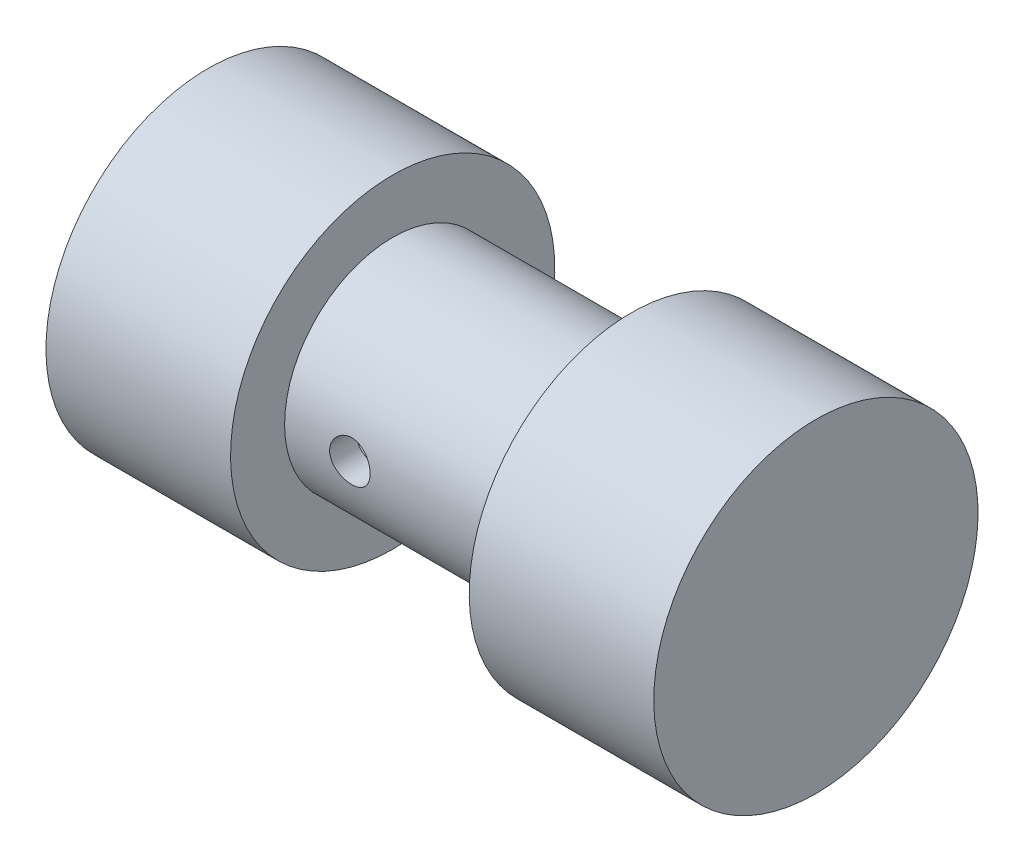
from build123d import *

# Parameters (mm, degrees)
CUT_EXTRUDE1_DEPTH      = 23.367278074
CUT_EXTRUDE1_DEPTH_BACK = 23.367278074
SKETCH2_R               = 1.190625


with BuildPart() as part:
    # Sketch1 → Revolve1 (revolve)
    with BuildSketch(Plane.XY, mode=Mode.PRIVATE) as revolve1_sk:
        Polygon((17.8562, 0), (17.8562, 9.525), (7.0104, 9.525), (7.0104, 6.35), (-7.0104, 6.35), (-7.0104, 9.525), (-17.8562, 9.525), (-17.8562, 4.7625), (1.1938, 4.7625), (1.1938, 0), align=None)
    revolve(revolve1_sk.sketch.rotate(Axis((0, 0, 0), (1, 0, 0)), 180), axis=Axis((0, 0, 0), (1, 0, 0)))

    # Sketch2 → Cut-Extrude1 (cut, two sides: drawn at the far end of the back side and taken through both)
    with BuildSketch(Plane.XY.offset(-CUT_EXTRUDE1_DEPTH_BACK)):
        with Locations((-3.175, 0)):
            Circle(SKETCH2_R)
    extrude(amount=CUT_EXTRUDE1_DEPTH + CUT_EXTRUDE1_DEPTH_BACK, mode=Mode.SUBTRACT)


solid = part.part
